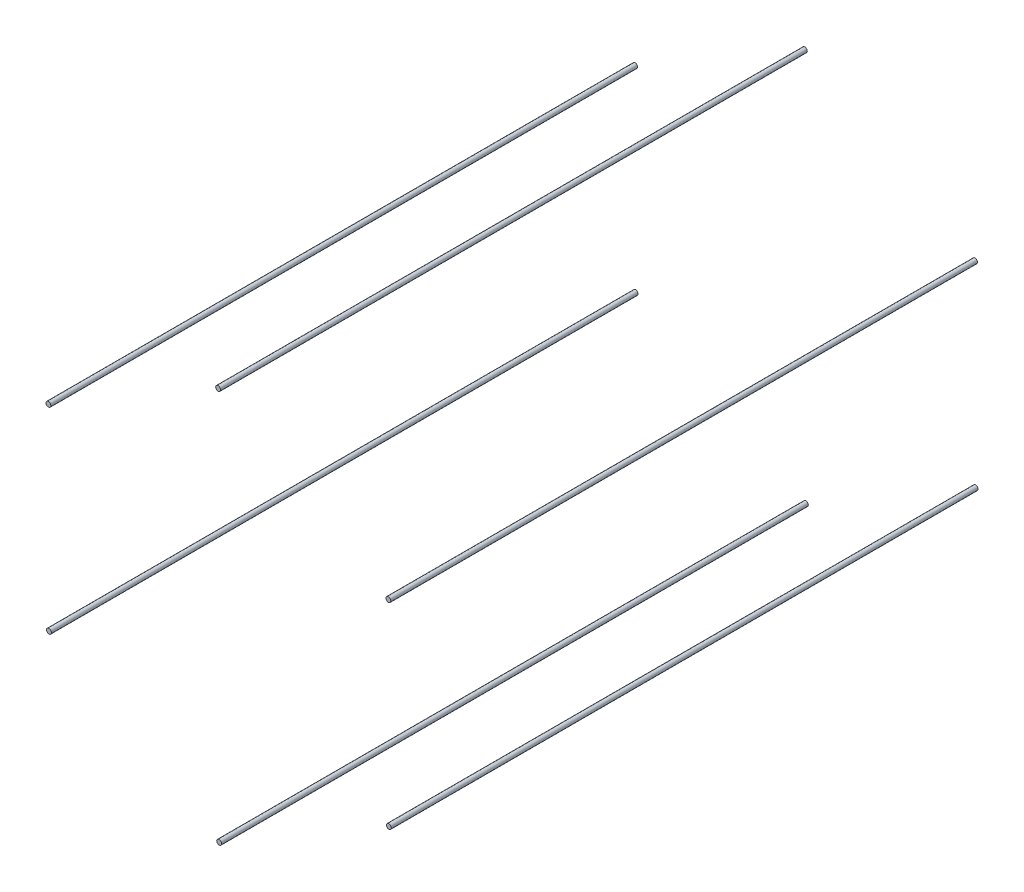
from build123d import *

# Parameters (mm, degrees)
SKETCH4_R             = 6.35
BOSS_EXTRUDE2_DEPTH   = 768.35
BOSS_EXTRUDE2_2_DEPTH = 768.35
BOSS_EXTRUDE2_3_DEPTH = 768.35
BOSS_EXTRUDE2_4_DEPTH = 768.35
BOSS_EXTRUDE2_5_DEPTH = 768.35
BOSS_EXTRUDE2_6_DEPTH = 768.35


with BuildPart() as part:
    # Sketch4 → Boss-Extrude2 (new, symmetric)
    with BuildSketch(Plane(origin=(0, 0, 0), x_dir=(0, 1, 0), z_dir=(0, 0, 1))):
        with Locations(Location((513.26438931, 0, 0), (0, 0, 270))):
            Circle(SKETCH4_R)
    extrude(amount=BOSS_EXTRUDE2_DEPTH, both=True)


with BuildPart() as body_2:
    # Sketch4 → Boss-Extrude2 2 (new, symmetric)
    with BuildSketch(Plane(origin=(0, 0, 0), x_dir=(0, 1, 0), z_dir=(0, 0, 1))):
        with Locations(Location((257.411617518, -445.85, 0), (0, 0, 270))):
            Circle(SKETCH4_R)
    extrude(amount=BOSS_EXTRUDE2_2_DEPTH, both=True)


with BuildPart() as body_3:
    # Sketch4 → Boss-Extrude2 3 (new, symmetric)
    with BuildSketch(Plane(origin=(0, 0, 0), x_dir=(0, 1, 0), z_dir=(0, 0, 1))):
        with Locations(Location((-256.632194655, -447.2, 0), (0, 0, 270))):
            Circle(SKETCH4_R)
    extrude(amount=BOSS_EXTRUDE2_3_DEPTH, both=True)


with BuildPart() as body_4:
    # Sketch4 → Boss-Extrude2 4 (new, symmetric)
    with BuildSketch(Plane(origin=(0, 0, 0), x_dir=(0, 1, 0), z_dir=(0, 0, 1))):
        with Locations(Location((-514.823235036, -2.7, 0), (0, 0, 270))):
            Circle(SKETCH4_R)
    extrude(amount=BOSS_EXTRUDE2_4_DEPTH, both=True)


with BuildPart() as body_5:
    # Sketch4 → Boss-Extrude2 5 (new, symmetric)
    with BuildSketch(Plane(origin=(0, 0, 0), x_dir=(0, 1, 0), z_dir=(0, 0, 1))):
        with Locations(Location((-258.970463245, 443.15, 0), (0, 0, 270))):
            Circle(SKETCH4_R)
    extrude(amount=BOSS_EXTRUDE2_5_DEPTH, both=True)


with BuildPart() as body_6:
    # Sketch4 → Boss-Extrude2 6 (new, symmetric)
    with BuildSketch(Plane(origin=(0, 0, 0), x_dir=(0, 1, 0), z_dir=(0, 0, 1))):
        with Locations(Location((255.073348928, 444.5, 0), (0, 0, 270))):
            Circle(SKETCH4_R)
    extrude(amount=BOSS_EXTRUDE2_6_DEPTH, both=True)


solid = Compound([part.part, body_2.part, body_3.part, body_4.part, body_5.part, body_6.part])
